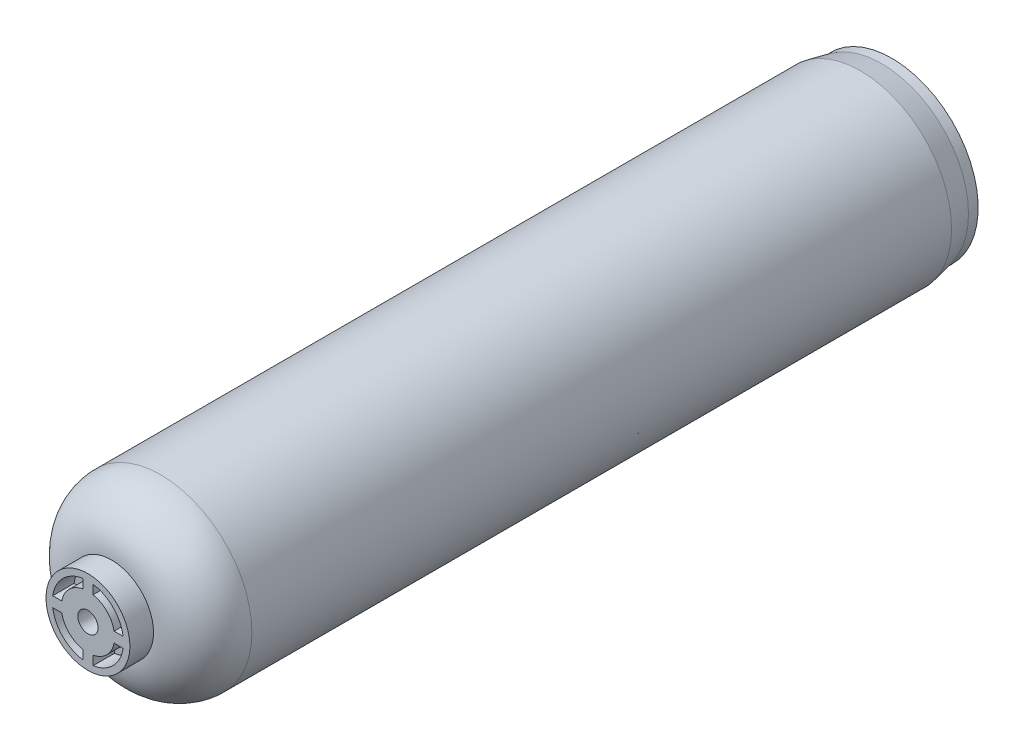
ISO-10303-21;
HEADER;
FILE_DESCRIPTION(('STEP AP214'),'2;1');
FILE_NAME('part.step','',(''),(''),'','','');
FILE_SCHEMA(('AUTOMOTIVE_DESIGN { 1 0 10303 214 1 1 1 1 }'));
ENDSEC;
DATA;
#1=APPLICATION_CONTEXT('core data for automotive mechanical design processes');
#2=APPLICATION_PROTOCOL_DEFINITION('international standard','automotive_design',2000,#1);
#3=PRODUCT_CONTEXT('',#1,'mechanical');
#4=PRODUCT('Part','Part','',(#3));
#5=PRODUCT_RELATED_PRODUCT_CATEGORY('part','',(#4));
#6=PRODUCT_DEFINITION_FORMATION('','',#4);
#7=PRODUCT_DEFINITION_CONTEXT('part definition',#1,'design');
#8=PRODUCT_DEFINITION('design','',#6,#7);
#9=PRODUCT_DEFINITION_SHAPE('','',#8);
#10=(LENGTH_UNIT() NAMED_UNIT(*) SI_UNIT(.MILLI.,.METRE.));
#11=(NAMED_UNIT(*) PLANE_ANGLE_UNIT() SI_UNIT($,.RADIAN.));
#12=(NAMED_UNIT(*) SI_UNIT($,.STERADIAN.) SOLID_ANGLE_UNIT());
#13=UNCERTAINTY_MEASURE_WITH_UNIT(LENGTH_MEASURE(1.E-05),#10,'distance_accuracy_value','');
#14=(GEOMETRIC_REPRESENTATION_CONTEXT(3) GLOBAL_UNCERTAINTY_ASSIGNED_CONTEXT((#13)) GLOBAL_UNIT_ASSIGNED_CONTEXT((#10,
#11,#12)) REPRESENTATION_CONTEXT('',''));
#15=CARTESIAN_POINT('',(0.,0.,0.));
#16=DIRECTION('',(0.,0.,1.));
#17=DIRECTION('',(1.,0.,0.));
#18=AXIS2_PLACEMENT_3D('',#15,#16,#17);
#19=CARTESIAN_POINT('',(0.,28.194,-273.742032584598));
#20=DIRECTION('',(0.,0.,-1.));
#21=DIRECTION('',(-1.,0.,0.));
#22=AXIS2_PLACEMENT_3D('',#19,#20,#21);
#23=PLANE('',#22);
#24=CARTESIAN_POINT('',(0.,0.,-273.742032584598));
#25=DIRECTION('',(0.,0.,-1.));
#26=DIRECTION('',(-1.,0.,0.));
#27=AXIS2_PLACEMENT_3D('',#24,#25,#26);
#28=CIRCLE('',#27,28.194);
#29=CARTESIAN_POINT('',(-28.194,0.,-273.742032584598));
#30=VERTEX_POINT('',#29);
#31=EDGE_CURVE('E324',#30,#30,#28,.T.);
#32=ORIENTED_EDGE('',*,*,#31,.T.);
#33=EDGE_LOOP('',(#32));
#34=FACE_BOUND('',#33,.T.);
#35=CARTESIAN_POINT('',(0.,0.,-273.742032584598));
#36=DIRECTION('',(0.,0.,-1.));
#37=DIRECTION('',(-1.,0.,0.));
#38=AXIS2_PLACEMENT_3D('',#35,#36,#37);
#39=CIRCLE('',#38,28.575);
#40=CARTESIAN_POINT('',(-28.575,0.,-273.742032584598));
#41=VERTEX_POINT('',#40);
#42=EDGE_CURVE('E321',#41,#41,#39,.F.);
#43=ORIENTED_EDGE('',*,*,#42,.T.);
#44=EDGE_LOOP('',(#43));
#45=FACE_BOUND('',#44,.T.);
#46=ADVANCED_FACE('F25',(#34,#45),#23,.F.);
#47=CARTESIAN_POINT('',(0.,0.,0.));
#48=DIRECTION('',(0.,0.,-1.));
#49=DIRECTION('',(-1.,0.,0.));
#50=AXIS2_PLACEMENT_3D('',#47,#48,#49);
#51=CYLINDRICAL_SURFACE('',#50,28.194);
#52=CARTESIAN_POINT('',(0.,0.,-279.584032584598));
#53=DIRECTION('',(0.,0.,-1.));
#54=DIRECTION('',(-1.,0.,0.));
#55=AXIS2_PLACEMENT_3D('',#52,#53,#54);
#56=CIRCLE('',#55,28.194);
#57=CARTESIAN_POINT('',(-28.194,0.,-279.584032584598));
#58=VERTEX_POINT('',#57);
#59=EDGE_CURVE('E318',#58,#58,#56,.T.);
#60=ORIENTED_EDGE('',*,*,#59,.T.);
#61=EDGE_LOOP('',(#60));
#62=FACE_BOUND('',#61,.T.);
#63=ORIENTED_EDGE('',*,*,#31,.F.);
#64=EDGE_LOOP('',(#63));
#65=FACE_BOUND('',#64,.T.);
#66=ADVANCED_FACE('F330',(#62,#65),#51,.F.);
#67=CARTESIAN_POINT('',(0.,0.,0.));
#68=DIRECTION('',(0.,0.,-1.));
#69=DIRECTION('',(-1.,0.,0.));
#70=AXIS2_PLACEMENT_3D('',#67,#68,#69);
#71=CYLINDRICAL_SURFACE('',#70,28.575);
#72=ORIENTED_EDGE('',*,*,#42,.F.);
#73=EDGE_LOOP('',(#72));
#74=FACE_BOUND('',#73,.T.);
#75=CARTESIAN_POINT('',(0.,0.,-271.329032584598));
#76=DIRECTION('',(0.,0.,-1.));
#77=DIRECTION('',(-1.,0.,0.));
#78=AXIS2_PLACEMENT_3D('',#75,#76,#77);
#79=CIRCLE('',#78,28.575);
#80=CARTESIAN_POINT('',(-28.575,0.,-271.329032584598));
#81=VERTEX_POINT('',#80);
#82=EDGE_CURVE('E315',#81,#81,#79,.F.);
#83=ORIENTED_EDGE('',*,*,#82,.T.);
#84=EDGE_LOOP('',(#83));
#85=FACE_BOUND('',#84,.T.);
#86=ADVANCED_FACE('F332',(#74,#85),#71,.F.);
#87=CARTESIAN_POINT('',(0.,28.575,-279.584032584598));
#88=DIRECTION('',(0.,0.,1.));
#89=DIRECTION('',(1.,0.,0.));
#90=AXIS2_PLACEMENT_3D('',#87,#88,#89);
#91=PLANE('',#90);
#92=ORIENTED_EDGE('',*,*,#59,.F.);
#93=EDGE_LOOP('',(#92));
#94=FACE_BOUND('',#93,.T.);
#95=CARTESIAN_POINT('',(0.,0.,-279.584032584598));
#96=DIRECTION('',(0.,0.,-1.));
#97=DIRECTION('',(-1.,0.,0.));
#98=AXIS2_PLACEMENT_3D('',#95,#96,#97);
#99=CIRCLE('',#98,28.575);
#100=CARTESIAN_POINT('',(-28.575,0.,-279.584032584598));
#101=VERTEX_POINT('',#100);
#102=EDGE_CURVE('E312',#101,#101,#99,.T.);
#103=ORIENTED_EDGE('',*,*,#102,.T.);
#104=EDGE_LOOP('',(#103));
#105=FACE_BOUND('',#104,.T.);
#106=ADVANCED_FACE('F339',(#94,#105),#91,.F.);
#107=CARTESIAN_POINT('',(0.,28.575,-271.329032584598));
#108=DIRECTION('',(0.,0.,1.));
#109=DIRECTION('',(1.,0.,0.));
#110=AXIS2_PLACEMENT_3D('',#107,#108,#109);
#111=PLANE('',#110);
#112=CARTESIAN_POINT('',(0.,0.,-271.329032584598));
#113=DIRECTION('',(0.,0.,-1.));
#114=DIRECTION('',(-1.,0.,0.));
#115=AXIS2_PLACEMENT_3D('',#112,#113,#114);
#116=CIRCLE('',#115,28.194);
#117=CARTESIAN_POINT('',(-28.194,0.,-271.329032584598));
#118=VERTEX_POINT('',#117);
#119=EDGE_CURVE('E309',#118,#118,#116,.F.);
#120=ORIENTED_EDGE('',*,*,#119,.T.);
#121=EDGE_LOOP('',(#120));
#122=FACE_BOUND('',#121,.T.);
#123=ORIENTED_EDGE('',*,*,#82,.F.);
#124=EDGE_LOOP('',(#123));
#125=FACE_BOUND('',#124,.T.);
#126=ADVANCED_FACE('F528',(#122,#125),#111,.F.);
#127=CARTESIAN_POINT('',(0.,0.,0.));
#128=DIRECTION('',(0.,0.,-1.));
#129=DIRECTION('',(-1.,0.,0.));
#130=AXIS2_PLACEMENT_3D('',#127,#128,#129);
#131=CYLINDRICAL_SURFACE('',#130,28.575);
#132=CARTESIAN_POINT('',(0.,0.,-283.648032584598));
#133=DIRECTION('',(0.,0.,-1.));
#134=DIRECTION('',(-1.,0.,0.));
#135=AXIS2_PLACEMENT_3D('',#132,#133,#134);
#136=CIRCLE('',#135,28.575);
#137=CARTESIAN_POINT('',(-28.575,0.,-283.648032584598));
#138=VERTEX_POINT('',#137);
#139=EDGE_CURVE('E247',#138,#138,#136,.T.);
#140=ORIENTED_EDGE('',*,*,#139,.T.);
#141=EDGE_LOOP('',(#140));
#142=FACE_BOUND('',#141,.T.);
#143=ORIENTED_EDGE('',*,*,#102,.F.);
#144=EDGE_LOOP('',(#143));
#145=FACE_BOUND('',#144,.T.);
#146=ADVANCED_FACE('F522',(#142,#145),#131,.F.);
#147=CARTESIAN_POINT('',(0.,0.,0.));
#148=DIRECTION('',(0.,0.,-1.));
#149=DIRECTION('',(-1.,0.,0.));
#150=AXIS2_PLACEMENT_3D('',#147,#148,#149);
#151=CYLINDRICAL_SURFACE('',#150,28.194);
#152=ORIENTED_EDGE('',*,*,#119,.F.);
#153=EDGE_LOOP('',(#152));
#154=FACE_BOUND('',#153,.T.);
#155=CARTESIAN_POINT('',(0.,0.,-25.9842));
#156=DIRECTION('',(0.,0.,1.));
#157=DIRECTION('',(1.,0.,0.));
#158=AXIS2_PLACEMENT_3D('',#155,#156,#157);
#159=CIRCLE('',#158,28.194);
#160=CARTESIAN_POINT('',(28.194,0.,-25.9842));
#161=VERTEX_POINT('',#160);
#162=EDGE_CURVE('E239',#161,#161,#159,.T.);
#163=ORIENTED_EDGE('',*,*,#162,.T.);
#164=EDGE_LOOP('',(#163));
#165=FACE_BOUND('',#164,.T.);
#166=ADVANCED_FACE('F517',(#154,#165),#151,.F.);
#167=CARTESIAN_POINT('',(0.,29.5275,-283.648032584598));
#168=DIRECTION('',(0.,0.,1.));
#169=DIRECTION('',(1.,0.,0.));
#170=AXIS2_PLACEMENT_3D('',#167,#168,#169);
#171=PLANE('',#170);
#172=ORIENTED_EDGE('',*,*,#139,.F.);
#173=EDGE_LOOP('',(#172));
#174=FACE_BOUND('',#173,.T.);
#175=CARTESIAN_POINT('',(0.,0.,-283.648032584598));
#176=DIRECTION('',(0.,0.,-1.));
#177=DIRECTION('',(-1.,0.,0.));
#178=AXIS2_PLACEMENT_3D('',#175,#176,#177);
#179=CIRCLE('',#178,29.5275);
#180=CARTESIAN_POINT('',(-29.5275,0.,-283.648032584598));
#181=VERTEX_POINT('',#180);
#182=EDGE_CURVE('E160',#181,#181,#179,.T.);
#183=ORIENTED_EDGE('',*,*,#182,.T.);
#184=EDGE_LOOP('',(#183));
#185=FACE_BOUND('',#184,.T.);
#186=ADVANCED_FACE('F231',(#174,#185),#171,.F.);
#187=CARTESIAN_POINT('',(0.,0.,-25.9842));
#188=DIRECTION('',(0.,0.,1.));
#189=DIRECTION('',(1.,0.,0.));
#190=AXIS2_PLACEMENT_3D('',#187,#188,#189);
#191=TOROIDAL_SURFACE('',#190,14.9606,13.2334);
#192=ORIENTED_EDGE('',*,*,#162,.F.);
#193=EDGE_LOOP('',(#192));
#194=FACE_BOUND('',#193,.T.);
#195=CARTESIAN_POINT('',(0.,0.,-12.7508));
#196=DIRECTION('',(0.,0.,1.));
#197=DIRECTION('',(-1.,0.,0.));
#198=AXIS2_PLACEMENT_3D('',#195,#196,#197);
#199=CIRCLE('',#198,14.9606);
#200=CARTESIAN_POINT('',(-14.9606,0.,-12.7508));
#201=VERTEX_POINT('',#200);
#202=CARTESIAN_POINT('',(14.9606,0.,-12.7508));
#203=VERTEX_POINT('',#202);
#204=EDGE_CURVE('E147',#201,#203,#199,.T.);
#205=ORIENTED_EDGE('',*,*,#204,.T.);
#206=CARTESIAN_POINT('',(0.,0.,-12.7508));
#207=DIRECTION('',(0.,0.,1.));
#208=DIRECTION('',(1.,0.,0.));
#209=AXIS2_PLACEMENT_3D('',#206,#207,#208);
#210=CIRCLE('',#209,14.9606);
#211=EDGE_CURVE('E150',#203,#201,#210,.T.);
#212=ORIENTED_EDGE('',*,*,#211,.T.);
#213=EDGE_LOOP('',(#205,#212));
#214=FACE_BOUND('',#213,.T.);
#215=ADVANCED_FACE('F152',(#194,#214),#191,.F.);
#216=CARTESIAN_POINT('',(0.,0.,0.));
#217=DIRECTION('',(0.,0.,-1.));
#218=DIRECTION('',(-1.,0.,0.));
#219=AXIS2_PLACEMENT_3D('',#216,#217,#218);
#220=CYLINDRICAL_SURFACE('',#219,29.5275);
#221=CARTESIAN_POINT('',(0.,0.,-286.823032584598));
#222=DIRECTION('',(0.,0.,1.));
#223=DIRECTION('',(1.,0.,0.));
#224=AXIS2_PLACEMENT_3D('',#221,#222,#223);
#225=CIRCLE('',#224,29.5275);
#226=CARTESIAN_POINT('',(29.5275,0.,-286.823032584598));
#227=VERTEX_POINT('',#226);
#228=EDGE_CURVE('E155',#227,#227,#225,.T.);
#229=ORIENTED_EDGE('',*,*,#228,.F.);
#230=EDGE_LOOP('',(#229));
#231=FACE_BOUND('',#230,.T.);
#232=ORIENTED_EDGE('',*,*,#182,.F.);
#233=EDGE_LOOP('',(#232));
#234=FACE_BOUND('',#233,.T.);
#235=ADVANCED_FACE('F230',(#231,#234),#220,.F.);
#236=CARTESIAN_POINT('',(0.,0.,-7.62));
#237=DIRECTION('',(0.,0.,1.));
#238=DIRECTION('',(1.,0.,0.));
#239=AXIS2_PLACEMENT_3D('',#236,#237,#238);
#240=PLANE('',#239);
#241=CARTESIAN_POINT('',(0.,0.,-7.62));
#242=DIRECTION('',(0.,0.,-1.));
#243=DIRECTION('',(-1.,0.,0.));
#244=AXIS2_PLACEMENT_3D('',#241,#242,#243);
#245=CIRCLE('',#244,9.525);
#246=CARTESIAN_POINT('',(9.34529307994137,1.8415,-7.62));
#247=VERTEX_POINT('',#246);
#248=CARTESIAN_POINT('',(1.8415,9.34529307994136,-7.62));
#249=VERTEX_POINT('',#248);
#250=EDGE_CURVE('E140',#247,#249,#245,.F.);
#251=ORIENTED_EDGE('',*,*,#250,.F.);
#252=DIRECTION('',(1.,0.,0.));
#253=VECTOR('',#252,1.);
#254=CARTESIAN_POINT('',(9.34529307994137,1.8415,-7.62));
#255=LINE('',#254,#253);
#256=CARTESIAN_POINT('',(12.5657820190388,1.8415,-7.62));
#257=VERTEX_POINT('',#256);
#258=EDGE_CURVE('E220',#247,#257,#255,.T.);
#259=ORIENTED_EDGE('',*,*,#258,.T.);
#260=CARTESIAN_POINT('',(0.,0.,-7.62));
#261=DIRECTION('',(0.,0.,-1.));
#262=DIRECTION('',(-1.,0.,0.));
#263=AXIS2_PLACEMENT_3D('',#260,#261,#262);
#264=CIRCLE('',#263,12.7);
#265=CARTESIAN_POINT('',(1.8415,12.5657820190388,-7.62));
#266=VERTEX_POINT('',#265);
#267=EDGE_CURVE('E302',#257,#266,#264,.F.);
#268=ORIENTED_EDGE('',*,*,#267,.T.);
#269=DIRECTION('',(0.,1.,0.));
#270=VECTOR('',#269,1.);
#271=CARTESIAN_POINT('',(1.8415,12.5657820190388,-7.62));
#272=LINE('',#271,#270);
#273=EDGE_CURVE('E216',#266,#249,#272,.F.);
#274=ORIENTED_EDGE('',*,*,#273,.T.);
#275=EDGE_LOOP('',(#251,#259,#268,#274));
#276=FACE_BOUND('',#275,.T.);
#277=ADVANCED_FACE('F408',(#276),#240,.T.);
#278=CARTESIAN_POINT('',(0.,0.,-7.62));
#279=DIRECTION('',(0.,0.,1.));
#280=DIRECTION('',(1.,0.,0.));
#281=AXIS2_PLACEMENT_3D('',#278,#279,#280);
#282=PLANE('',#281);
#283=CARTESIAN_POINT('',(0.,0.,-7.62));
#284=DIRECTION('',(0.,0.,-1.));
#285=DIRECTION('',(-1.,0.,0.));
#286=AXIS2_PLACEMENT_3D('',#283,#284,#285);
#287=CIRCLE('',#286,9.525);
#288=CARTESIAN_POINT('',(1.8415,-9.34529307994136,-7.62));
#289=VERTEX_POINT('',#288);
#290=CARTESIAN_POINT('',(9.34529307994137,-1.8415,-7.62));
#291=VERTEX_POINT('',#290);
#292=EDGE_CURVE('E299',#289,#291,#287,.F.);
#293=ORIENTED_EDGE('',*,*,#292,.F.);
#294=DIRECTION('',(0.,-1.,0.));
#295=VECTOR('',#294,1.);
#296=CARTESIAN_POINT('',(1.8415,-9.34529307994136,-7.62));
#297=LINE('',#296,#295);
#298=CARTESIAN_POINT('',(1.84150000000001,-12.5657820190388,-7.62));
#299=VERTEX_POINT('',#298);
#300=EDGE_CURVE('E212',#289,#299,#297,.T.);
#301=ORIENTED_EDGE('',*,*,#300,.T.);
#302=CARTESIAN_POINT('',(0.,0.,-7.62));
#303=DIRECTION('',(0.,0.,-1.));
#304=DIRECTION('',(-1.,0.,0.));
#305=AXIS2_PLACEMENT_3D('',#302,#303,#304);
#306=CIRCLE('',#305,12.7);
#307=CARTESIAN_POINT('',(12.5657820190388,-1.8415,-7.62));
#308=VERTEX_POINT('',#307);
#309=EDGE_CURVE('E297',#299,#308,#306,.F.);
#310=ORIENTED_EDGE('',*,*,#309,.T.);
#311=DIRECTION('',(1.,0.,0.));
#312=VECTOR('',#311,1.);
#313=CARTESIAN_POINT('',(9.34529307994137,-1.8415,-7.62));
#314=LINE('',#313,#312);
#315=EDGE_CURVE('E208',#308,#291,#314,.F.);
#316=ORIENTED_EDGE('',*,*,#315,.T.);
#317=EDGE_LOOP('',(#293,#301,#310,#316));
#318=FACE_BOUND('',#317,.T.);
#319=ADVANCED_FACE('F587',(#318),#282,.T.);
#320=CARTESIAN_POINT('',(0.,0.,-7.62));
#321=DIRECTION('',(0.,0.,1.));
#322=DIRECTION('',(1.,0.,0.));
#323=AXIS2_PLACEMENT_3D('',#320,#321,#322);
#324=PLANE('',#323);
#325=CARTESIAN_POINT('',(0.,0.,-7.62));
#326=DIRECTION('',(0.,0.,-1.));
#327=DIRECTION('',(-1.,0.,0.));
#328=AXIS2_PLACEMENT_3D('',#325,#326,#327);
#329=CIRCLE('',#328,12.7);
#330=CARTESIAN_POINT('',(-12.5657820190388,-1.8415,-7.62));
#331=VERTEX_POINT('',#330);
#332=CARTESIAN_POINT('',(-1.8415,-12.5657820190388,-7.62));
#333=VERTEX_POINT('',#332);
#334=EDGE_CURVE('E295',#331,#333,#329,.F.);
#335=ORIENTED_EDGE('',*,*,#334,.T.);
#336=DIRECTION('',(0.,1.,0.));
#337=VECTOR('',#336,1.);
#338=CARTESIAN_POINT('',(-1.8415,-9.34529307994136,-7.62));
#339=LINE('',#338,#337);
#340=CARTESIAN_POINT('',(-1.8415,-9.34529307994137,-7.62));
#341=VERTEX_POINT('',#340);
#342=EDGE_CURVE('E204',#333,#341,#339,.T.);
#343=ORIENTED_EDGE('',*,*,#342,.T.);
#344=CARTESIAN_POINT('',(0.,0.,-7.62));
#345=DIRECTION('',(0.,0.,-1.));
#346=DIRECTION('',(-1.,0.,0.));
#347=AXIS2_PLACEMENT_3D('',#344,#345,#346);
#348=CIRCLE('',#347,9.525);
#349=CARTESIAN_POINT('',(-9.34529307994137,-1.8415,-7.62));
#350=VERTEX_POINT('',#349);
#351=EDGE_CURVE('E206',#350,#341,#348,.F.);
#352=ORIENTED_EDGE('',*,*,#351,.F.);
#353=DIRECTION('',(1.,0.,0.));
#354=VECTOR('',#353,1.);
#355=CARTESIAN_POINT('',(-12.5657820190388,-1.8415,-7.62));
#356=LINE('',#355,#354);
#357=EDGE_CURVE('E200',#350,#331,#356,.F.);
#358=ORIENTED_EDGE('',*,*,#357,.T.);
#359=EDGE_LOOP('',(#335,#343,#352,#358));
#360=FACE_BOUND('',#359,.T.);
#361=ADVANCED_FACE('F595',(#360),#324,.T.);
#362=CARTESIAN_POINT('',(0.,0.,-7.62));
#363=DIRECTION('',(0.,0.,1.));
#364=DIRECTION('',(1.,0.,0.));
#365=AXIS2_PLACEMENT_3D('',#362,#363,#364);
#366=PLANE('',#365);
#367=CARTESIAN_POINT('',(0.,0.,-7.62));
#368=DIRECTION('',(0.,0.,-1.));
#369=DIRECTION('',(-1.,0.,0.));
#370=AXIS2_PLACEMENT_3D('',#367,#368,#369);
#371=CIRCLE('',#370,12.7);
#372=CARTESIAN_POINT('',(-1.8415,12.5657820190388,-7.62));
#373=VERTEX_POINT('',#372);
#374=CARTESIAN_POINT('',(-12.5657820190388,1.8415,-7.62));
#375=VERTEX_POINT('',#374);
#376=EDGE_CURVE('E290',#373,#375,#371,.F.);
#377=ORIENTED_EDGE('',*,*,#376,.T.);
#378=DIRECTION('',(1.,0.,0.));
#379=VECTOR('',#378,1.);
#380=CARTESIAN_POINT('',(-12.5657820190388,1.8415,-7.62));
#381=LINE('',#380,#379);
#382=CARTESIAN_POINT('',(-9.34529307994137,1.8415,-7.62));
#383=VERTEX_POINT('',#382);
#384=EDGE_CURVE('E196',#375,#383,#381,.T.);
#385=ORIENTED_EDGE('',*,*,#384,.T.);
#386=CARTESIAN_POINT('',(0.,0.,-7.62));
#387=DIRECTION('',(0.,0.,-1.));
#388=DIRECTION('',(-1.,0.,0.));
#389=AXIS2_PLACEMENT_3D('',#386,#387,#388);
#390=CIRCLE('',#389,9.525);
#391=CARTESIAN_POINT('',(-1.8415,9.34529307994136,-7.62));
#392=VERTEX_POINT('',#391);
#393=EDGE_CURVE('E198',#392,#383,#390,.F.);
#394=ORIENTED_EDGE('',*,*,#393,.F.);
#395=DIRECTION('',(0.,1.,0.));
#396=VECTOR('',#395,1.);
#397=CARTESIAN_POINT('',(-1.8415,12.5657820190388,-7.62));
#398=LINE('',#397,#396);
#399=EDGE_CURVE('E187',#392,#373,#398,.T.);
#400=ORIENTED_EDGE('',*,*,#399,.T.);
#401=EDGE_LOOP('',(#377,#385,#394,#400));
#402=FACE_BOUND('',#401,.T.);
#403=ADVANCED_FACE('F179',(#402),#366,.T.);
#404=CARTESIAN_POINT('',(0.,14.9606,-12.7508));
#405=DIRECTION('',(0.,0.,1.));
#406=DIRECTION('',(1.,0.,0.));
#407=AXIS2_PLACEMENT_3D('',#404,#405,#406);
#408=PLANE('',#407);
#409=CARTESIAN_POINT('',(0.,0.,-12.7508));
#410=DIRECTION('',(0.,0.,-1.));
#411=DIRECTION('',(-1.,0.,0.));
#412=AXIS2_PLACEMENT_3D('',#409,#410,#411);
#413=CIRCLE('',#412,3.6195);
#414=CARTESIAN_POINT('',(-3.6195,0.,-12.7508));
#415=VERTEX_POINT('',#414);
#416=EDGE_CURVE('E284',#415,#415,#413,.F.);
#417=ORIENTED_EDGE('',*,*,#416,.T.);
#418=EDGE_LOOP('',(#417));
#419=FACE_BOUND('',#418,.T.);
#420=ORIENTED_EDGE('',*,*,#204,.F.);
#421=ORIENTED_EDGE('',*,*,#211,.F.);
#422=EDGE_LOOP('',(#420,#421));
#423=FACE_BOUND('',#422,.T.);
#424=ADVANCED_FACE('F159',(#419,#423),#408,.F.);
#425=CARTESIAN_POINT('',(0.,0.,-286.813020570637));
#426=DIRECTION('',(0.,0.,1.));
#427=DIRECTION('',(1.,0.,0.));
#428=AXIS2_PLACEMENT_3D('',#425,#426,#427);
#429=CONICAL_SURFACE('',#428,30.7975,1.56291301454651);
#430=CARTESIAN_POINT('',(0.,0.,-286.813020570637));
#431=DIRECTION('',(0.,0.,-1.));
#432=DIRECTION('',(-1.,0.,0.));
#433=AXIS2_PLACEMENT_3D('',#430,#431,#432);
#434=CIRCLE('',#433,30.7975);
#435=CARTESIAN_POINT('',(-30.7975,0.,-286.813020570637));
#436=VERTEX_POINT('',#435);
#437=EDGE_CURVE('E163',#436,#436,#434,.F.);
#438=ORIENTED_EDGE('',*,*,#437,.F.);
#439=EDGE_LOOP('',(#438));
#440=FACE_BOUND('',#439,.T.);
#441=ORIENTED_EDGE('',*,*,#228,.T.);
#442=EDGE_LOOP('',(#441));
#443=FACE_BOUND('',#442,.T.);
#444=ADVANCED_FACE('F178',(#440,#443),#429,.T.);
#445=CARTESIAN_POINT('',(0.,0.,-7.62));
#446=DIRECTION('',(0.,0.,-1.));
#447=DIRECTION('',(-1.,0.,0.));
#448=AXIS2_PLACEMENT_3D('',#445,#446,#447);
#449=CYLINDRICAL_SURFACE('',#448,9.525);
#450=ORIENTED_EDGE('',*,*,#250,.T.);
#451=DIRECTION('',(0.,0.,1.));
#452=VECTOR('',#451,1.);
#453=CARTESIAN_POINT('',(1.8415,9.34529307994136,-7.62));
#454=LINE('',#453,#452);
#455=CARTESIAN_POINT('',(1.8415,9.34529307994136,0.));
#456=VERTEX_POINT('',#455);
#457=EDGE_CURVE('E218',#249,#456,#454,.T.);
#458=ORIENTED_EDGE('',*,*,#457,.T.);
#459=CARTESIAN_POINT('',(0.,0.,0.));
#460=DIRECTION('',(0.,0.,-1.));
#461=DIRECTION('',(-1.,0.,0.));
#462=AXIS2_PLACEMENT_3D('',#459,#460,#461);
#463=CIRCLE('',#462,9.525);
#464=CARTESIAN_POINT('',(9.34529307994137,1.8415,0.));
#465=VERTEX_POINT('',#464);
#466=EDGE_CURVE('E282',#456,#465,#463,.T.);
#467=ORIENTED_EDGE('',*,*,#466,.T.);
#468=DIRECTION('',(0.,0.,-1.));
#469=VECTOR('',#468,1.);
#470=CARTESIAN_POINT('',(9.34529307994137,1.8415,-7.62));
#471=LINE('',#470,#469);
#472=EDGE_CURVE('E223',#465,#247,#471,.T.);
#473=ORIENTED_EDGE('',*,*,#472,.T.);
#474=EDGE_LOOP('',(#450,#458,#467,#473));
#475=FACE_BOUND('',#474,.T.);
#476=ADVANCED_FACE('F400',(#475),#449,.T.);
#477=CARTESIAN_POINT('',(9.34529307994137,1.8415,-7.62));
#478=DIRECTION('',(0.,-1.,0.));
#479=DIRECTION('',(0.,0.,-1.));
#480=AXIS2_PLACEMENT_3D('',#477,#478,#479);
#481=PLANE('',#480);
#482=DIRECTION('',(0.,0.,-1.));
#483=VECTOR('',#482,1.);
#484=CARTESIAN_POINT('',(12.5657820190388,1.8415,-7.62));
#485=LINE('',#484,#483);
#486=CARTESIAN_POINT('',(12.5657820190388,1.8415,0.));
#487=VERTEX_POINT('',#486);
#488=EDGE_CURVE('E222',#487,#257,#485,.T.);
#489=ORIENTED_EDGE('',*,*,#488,.T.);
#490=ORIENTED_EDGE('',*,*,#258,.F.);
#491=ORIENTED_EDGE('',*,*,#472,.F.);
#492=DIRECTION('',(-1.,0.,0.));
#493=VECTOR('',#492,1.);
#494=CARTESIAN_POINT('',(0.,1.8415,0.));
#495=LINE('',#494,#493);
#496=EDGE_CURVE('E281',#465,#487,#495,.F.);
#497=ORIENTED_EDGE('',*,*,#496,.T.);
#498=EDGE_LOOP('',(#489,#490,#491,#497));
#499=FACE_BOUND('',#498,.T.);
#500=ADVANCED_FACE('F405',(#499),#481,.F.);
#501=CARTESIAN_POINT('',(0.,0.,-7.62));
#502=DIRECTION('',(0.,0.,-1.));
#503=DIRECTION('',(-1.,0.,0.));
#504=AXIS2_PLACEMENT_3D('',#501,#502,#503);
#505=CYLINDRICAL_SURFACE('',#504,12.7);
#506=DIRECTION('',(0.,0.,1.));
#507=VECTOR('',#506,1.);
#508=CARTESIAN_POINT('',(1.8415,12.5657820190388,-7.62));
#509=LINE('',#508,#507);
#510=CARTESIAN_POINT('',(1.8415,12.5657820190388,0.));
#511=VERTEX_POINT('',#510);
#512=EDGE_CURVE('E219',#511,#266,#509,.F.);
#513=ORIENTED_EDGE('',*,*,#512,.T.);
#514=ORIENTED_EDGE('',*,*,#267,.F.);
#515=ORIENTED_EDGE('',*,*,#488,.F.);
#516=CARTESIAN_POINT('',(0.,0.,0.));
#517=DIRECTION('',(0.,0.,-1.));
#518=DIRECTION('',(-1.,0.,0.));
#519=AXIS2_PLACEMENT_3D('',#516,#517,#518);
#520=CIRCLE('',#519,12.7);
#521=EDGE_CURVE('E279',#487,#511,#520,.F.);
#522=ORIENTED_EDGE('',*,*,#521,.T.);
#523=EDGE_LOOP('',(#513,#514,#515,#522));
#524=FACE_BOUND('',#523,.T.);
#525=ADVANCED_FACE('F412',(#524),#505,.F.);
#526=CARTESIAN_POINT('',(1.8415,12.5657820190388,-7.62));
#527=DIRECTION('',(-1.,0.,0.));
#528=DIRECTION('',(0.,0.,1.));
#529=AXIS2_PLACEMENT_3D('',#526,#527,#528);
#530=PLANE('',#529);
#531=ORIENTED_EDGE('',*,*,#457,.F.);
#532=ORIENTED_EDGE('',*,*,#273,.F.);
#533=ORIENTED_EDGE('',*,*,#512,.F.);
#534=DIRECTION('',(0.,1.,0.));
#535=VECTOR('',#534,1.);
#536=CARTESIAN_POINT('',(1.8415,3.6195,0.));
#537=LINE('',#536,#535);
#538=EDGE_CURVE('E278',#511,#456,#537,.F.);
#539=ORIENTED_EDGE('',*,*,#538,.T.);
#540=EDGE_LOOP('',(#531,#532,#533,#539));
#541=FACE_BOUND('',#540,.T.);
#542=ADVANCED_FACE('F416',(#541),#530,.F.);
#543=CARTESIAN_POINT('',(0.,0.,-7.62));
#544=DIRECTION('',(0.,0.,-1.));
#545=DIRECTION('',(-1.,0.,0.));
#546=AXIS2_PLACEMENT_3D('',#543,#544,#545);
#547=CYLINDRICAL_SURFACE('',#546,9.525);
#548=ORIENTED_EDGE('',*,*,#292,.T.);
#549=DIRECTION('',(0.,0.,1.));
#550=VECTOR('',#549,1.);
#551=CARTESIAN_POINT('',(9.34529307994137,-1.8415,-7.62));
#552=LINE('',#551,#550);
#553=CARTESIAN_POINT('',(9.34529307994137,-1.8415,0.));
#554=VERTEX_POINT('',#553);
#555=EDGE_CURVE('E210',#291,#554,#552,.T.);
#556=ORIENTED_EDGE('',*,*,#555,.T.);
#557=CARTESIAN_POINT('',(0.,0.,0.));
#558=DIRECTION('',(0.,0.,-1.));
#559=DIRECTION('',(-1.,0.,0.));
#560=AXIS2_PLACEMENT_3D('',#557,#558,#559);
#561=CIRCLE('',#560,9.525);
#562=CARTESIAN_POINT('',(1.8415,-9.34529307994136,0.));
#563=VERTEX_POINT('',#562);
#564=EDGE_CURVE('E276',#554,#563,#561,.T.);
#565=ORIENTED_EDGE('',*,*,#564,.T.);
#566=DIRECTION('',(0.,0.,1.));
#567=VECTOR('',#566,1.);
#568=CARTESIAN_POINT('',(1.8415,-9.34529307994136,-7.62));
#569=LINE('',#568,#567);
#570=EDGE_CURVE('E215',#563,#289,#569,.F.);
#571=ORIENTED_EDGE('',*,*,#570,.T.);
#572=EDGE_LOOP('',(#548,#556,#565,#571));
#573=FACE_BOUND('',#572,.T.);
#574=ADVANCED_FACE('F490',(#573),#547,.T.);
#575=CARTESIAN_POINT('',(1.8415,-9.34529307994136,-7.62));
#576=DIRECTION('',(-1.,0.,0.));
#577=DIRECTION('',(0.,-1.,0.));
#578=AXIS2_PLACEMENT_3D('',#575,#576,#577);
#579=PLANE('',#578);
#580=DIRECTION('',(0.,0.,-1.));
#581=VECTOR('',#580,1.);
#582=CARTESIAN_POINT('',(1.84150000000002,-12.5657820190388,-7.62));
#583=LINE('',#582,#581);
#584=CARTESIAN_POINT('',(1.84150000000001,-12.5657820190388,0.));
#585=VERTEX_POINT('',#584);
#586=EDGE_CURVE('E214',#585,#299,#583,.T.);
#587=ORIENTED_EDGE('',*,*,#586,.T.);
#588=ORIENTED_EDGE('',*,*,#300,.F.);
#589=ORIENTED_EDGE('',*,*,#570,.F.);
#590=DIRECTION('',(0.,1.,0.));
#591=VECTOR('',#590,1.);
#592=CARTESIAN_POINT('',(1.8415,3.6195,0.));
#593=LINE('',#592,#591);
#594=EDGE_CURVE('E275',#563,#585,#593,.F.);
#595=ORIENTED_EDGE('',*,*,#594,.T.);
#596=EDGE_LOOP('',(#587,#588,#589,#595));
#597=FACE_BOUND('',#596,.T.);
#598=ADVANCED_FACE('F486',(#597),#579,.F.);
#599=CARTESIAN_POINT('',(0.,0.,-7.62));
#600=DIRECTION('',(0.,0.,-1.));
#601=DIRECTION('',(-1.,0.,0.));
#602=AXIS2_PLACEMENT_3D('',#599,#600,#601);
#603=CYLINDRICAL_SURFACE('',#602,12.7);
#604=DIRECTION('',(0.,0.,1.));
#605=VECTOR('',#604,1.);
#606=CARTESIAN_POINT('',(12.5657820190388,-1.8415,-7.62));
#607=LINE('',#606,#605);
#608=CARTESIAN_POINT('',(12.5657820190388,-1.8415,0.));
#609=VERTEX_POINT('',#608);
#610=EDGE_CURVE('E211',#609,#308,#607,.F.);
#611=ORIENTED_EDGE('',*,*,#610,.T.);
#612=ORIENTED_EDGE('',*,*,#309,.F.);
#613=ORIENTED_EDGE('',*,*,#586,.F.);
#614=CARTESIAN_POINT('',(0.,0.,0.));
#615=DIRECTION('',(0.,0.,-1.));
#616=DIRECTION('',(-1.,0.,0.));
#617=AXIS2_PLACEMENT_3D('',#614,#615,#616);
#618=CIRCLE('',#617,12.7);
#619=EDGE_CURVE('E273',#585,#609,#618,.F.);
#620=ORIENTED_EDGE('',*,*,#619,.T.);
#621=EDGE_LOOP('',(#611,#612,#613,#620));
#622=FACE_BOUND('',#621,.T.);
#623=ADVANCED_FACE('F482',(#622),#603,.F.);
#624=CARTESIAN_POINT('',(9.34529307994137,-1.8415,-7.62));
#625=DIRECTION('',(0.,1.,0.));
#626=DIRECTION('',(0.,0.,1.));
#627=AXIS2_PLACEMENT_3D('',#624,#625,#626);
#628=PLANE('',#627);
#629=ORIENTED_EDGE('',*,*,#555,.F.);
#630=ORIENTED_EDGE('',*,*,#315,.F.);
#631=ORIENTED_EDGE('',*,*,#610,.F.);
#632=DIRECTION('',(-1.,0.,0.));
#633=VECTOR('',#632,1.);
#634=CARTESIAN_POINT('',(0.,-1.8415,0.));
#635=LINE('',#634,#633);
#636=EDGE_CURVE('E272',#609,#554,#635,.T.);
#637=ORIENTED_EDGE('',*,*,#636,.T.);
#638=EDGE_LOOP('',(#629,#630,#631,#637));
#639=FACE_BOUND('',#638,.T.);
#640=ADVANCED_FACE('F478',(#639),#628,.F.);
#641=CARTESIAN_POINT('',(0.,0.,-7.62));
#642=DIRECTION('',(0.,0.,-1.));
#643=DIRECTION('',(-1.,0.,0.));
#644=AXIS2_PLACEMENT_3D('',#641,#642,#643);
#645=CYLINDRICAL_SURFACE('',#644,12.7);
#646=DIRECTION('',(0.,0.,-1.));
#647=VECTOR('',#646,1.);
#648=CARTESIAN_POINT('',(-1.8415,-12.5657820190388,-7.62));
#649=LINE('',#648,#647);
#650=CARTESIAN_POINT('',(-1.84150000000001,-12.5657820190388,0.));
#651=VERTEX_POINT('',#650);
#652=EDGE_CURVE('E207',#651,#333,#649,.T.);
#653=ORIENTED_EDGE('',*,*,#652,.T.);
#654=ORIENTED_EDGE('',*,*,#334,.F.);
#655=DIRECTION('',(0.,0.,1.));
#656=VECTOR('',#655,1.);
#657=CARTESIAN_POINT('',(-12.5657820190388,-1.8415,-7.62));
#658=LINE('',#657,#656);
#659=CARTESIAN_POINT('',(-12.5657820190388,-1.8415,0.));
#660=VERTEX_POINT('',#659);
#661=EDGE_CURVE('E202',#331,#660,#658,.T.);
#662=ORIENTED_EDGE('',*,*,#661,.T.);
#663=CARTESIAN_POINT('',(0.,0.,0.));
#664=DIRECTION('',(0.,0.,-1.));
#665=DIRECTION('',(-1.,0.,0.));
#666=AXIS2_PLACEMENT_3D('',#663,#664,#665);
#667=CIRCLE('',#666,12.7);
#668=EDGE_CURVE('E270',#660,#651,#667,.F.);
#669=ORIENTED_EDGE('',*,*,#668,.T.);
#670=EDGE_LOOP('',(#653,#654,#662,#669));
#671=FACE_BOUND('',#670,.T.);
#672=ADVANCED_FACE('F474',(#671),#645,.F.);
#673=CARTESIAN_POINT('',(-1.8415,-9.34529307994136,-7.62));
#674=DIRECTION('',(1.,0.,0.));
#675=DIRECTION('',(0.,0.,-1.));
#676=AXIS2_PLACEMENT_3D('',#673,#674,#675);
#677=PLANE('',#676);
#678=DIRECTION('',(0.,0.,-1.));
#679=VECTOR('',#678,1.);
#680=CARTESIAN_POINT('',(-1.8415,-9.34529307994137,-7.62));
#681=LINE('',#680,#679);
#682=CARTESIAN_POINT('',(-1.8415,-9.34529307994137,0.));
#683=VERTEX_POINT('',#682);
#684=EDGE_CURVE('E294',#341,#683,#681,.F.);
#685=ORIENTED_EDGE('',*,*,#684,.F.);
#686=ORIENTED_EDGE('',*,*,#342,.F.);
#687=ORIENTED_EDGE('',*,*,#652,.F.);
#688=DIRECTION('',(0.,1.,0.));
#689=VECTOR('',#688,1.);
#690=CARTESIAN_POINT('',(-1.84150000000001,3.6195,0.));
#691=LINE('',#690,#689);
#692=EDGE_CURVE('E269',#651,#683,#691,.T.);
#693=ORIENTED_EDGE('',*,*,#692,.T.);
#694=EDGE_LOOP('',(#685,#686,#687,#693));
#695=FACE_BOUND('',#694,.T.);
#696=ADVANCED_FACE('F470',(#695),#677,.F.);
#697=CARTESIAN_POINT('',(0.,0.,-7.62));
#698=DIRECTION('',(0.,0.,-1.));
#699=DIRECTION('',(-1.,0.,0.));
#700=AXIS2_PLACEMENT_3D('',#697,#698,#699);
#701=CYLINDRICAL_SURFACE('',#700,9.525);
#702=ORIENTED_EDGE('',*,*,#351,.T.);
#703=ORIENTED_EDGE('',*,*,#684,.T.);
#704=CARTESIAN_POINT('',(0.,0.,0.));
#705=DIRECTION('',(0.,0.,-1.));
#706=DIRECTION('',(-1.,0.,0.));
#707=AXIS2_PLACEMENT_3D('',#704,#705,#706);
#708=CIRCLE('',#707,9.525);
#709=CARTESIAN_POINT('',(-9.34529307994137,-1.8415,0.));
#710=VERTEX_POINT('',#709);
#711=EDGE_CURVE('E267',#683,#710,#708,.T.);
#712=ORIENTED_EDGE('',*,*,#711,.T.);
#713=DIRECTION('',(0.,0.,1.));
#714=VECTOR('',#713,1.);
#715=CARTESIAN_POINT('',(-9.34529307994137,-1.8415,-7.62));
#716=LINE('',#715,#714);
#717=EDGE_CURVE('E203',#710,#350,#716,.F.);
#718=ORIENTED_EDGE('',*,*,#717,.T.);
#719=EDGE_LOOP('',(#702,#703,#712,#718));
#720=FACE_BOUND('',#719,.T.);
#721=ADVANCED_FACE('F466',(#720),#701,.T.);
#722=CARTESIAN_POINT('',(-12.5657820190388,-1.8415,-7.62));
#723=DIRECTION('',(0.,1.,0.));
#724=DIRECTION('',(0.,0.,1.));
#725=AXIS2_PLACEMENT_3D('',#722,#723,#724);
#726=PLANE('',#725);
#727=ORIENTED_EDGE('',*,*,#661,.F.);
#728=ORIENTED_EDGE('',*,*,#357,.F.);
#729=ORIENTED_EDGE('',*,*,#717,.F.);
#730=DIRECTION('',(-1.,0.,0.));
#731=VECTOR('',#730,1.);
#732=CARTESIAN_POINT('',(0.,-1.8415,0.));
#733=LINE('',#732,#731);
#734=EDGE_CURVE('E266',#710,#660,#733,.T.);
#735=ORIENTED_EDGE('',*,*,#734,.T.);
#736=EDGE_LOOP('',(#727,#728,#729,#735));
#737=FACE_BOUND('',#736,.T.);
#738=ADVANCED_FACE('F462',(#737),#726,.F.);
#739=CARTESIAN_POINT('',(0.,0.,-7.62));
#740=DIRECTION('',(0.,0.,-1.));
#741=DIRECTION('',(-1.,0.,0.));
#742=AXIS2_PLACEMENT_3D('',#739,#740,#741);
#743=CYLINDRICAL_SURFACE('',#742,12.7);
#744=DIRECTION('',(0.,0.,-1.));
#745=VECTOR('',#744,1.);
#746=CARTESIAN_POINT('',(-12.5657820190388,1.8415,-7.62));
#747=LINE('',#746,#745);
#748=CARTESIAN_POINT('',(-12.5657820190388,1.8415,0.));
#749=VERTEX_POINT('',#748);
#750=EDGE_CURVE('E199',#749,#375,#747,.T.);
#751=ORIENTED_EDGE('',*,*,#750,.T.);
#752=ORIENTED_EDGE('',*,*,#376,.F.);
#753=DIRECTION('',(0.,0.,-1.));
#754=VECTOR('',#753,1.);
#755=CARTESIAN_POINT('',(-1.8415,12.5657820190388,-7.62));
#756=LINE('',#755,#754);
#757=CARTESIAN_POINT('',(-1.8415,12.5657820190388,0.));
#758=VERTEX_POINT('',#757);
#759=EDGE_CURVE('E194',#373,#758,#756,.F.);
#760=ORIENTED_EDGE('',*,*,#759,.T.);
#761=CARTESIAN_POINT('',(0.,0.,0.));
#762=DIRECTION('',(0.,0.,-1.));
#763=DIRECTION('',(-1.,0.,0.));
#764=AXIS2_PLACEMENT_3D('',#761,#762,#763);
#765=CIRCLE('',#764,12.7);
#766=EDGE_CURVE('E264',#758,#749,#765,.F.);
#767=ORIENTED_EDGE('',*,*,#766,.T.);
#768=EDGE_LOOP('',(#751,#752,#760,#767));
#769=FACE_BOUND('',#768,.T.);
#770=ADVANCED_FACE('F458',(#769),#743,.F.);
#771=CARTESIAN_POINT('',(-12.5657820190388,1.8415,-7.62));
#772=DIRECTION('',(0.,-1.,0.));
#773=DIRECTION('',(0.,0.,-1.));
#774=AXIS2_PLACEMENT_3D('',#771,#772,#773);
#775=PLANE('',#774);
#776=DIRECTION('',(0.,0.,-1.));
#777=VECTOR('',#776,1.);
#778=CARTESIAN_POINT('',(-9.34529307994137,1.8415,-7.62));
#779=LINE('',#778,#777);
#780=CARTESIAN_POINT('',(-9.34529307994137,1.8415,0.));
#781=VERTEX_POINT('',#780);
#782=EDGE_CURVE('E289',#383,#781,#779,.F.);
#783=ORIENTED_EDGE('',*,*,#782,.F.);
#784=ORIENTED_EDGE('',*,*,#384,.F.);
#785=ORIENTED_EDGE('',*,*,#750,.F.);
#786=DIRECTION('',(-1.,0.,0.));
#787=VECTOR('',#786,1.);
#788=CARTESIAN_POINT('',(0.,1.8415,0.));
#789=LINE('',#788,#787);
#790=EDGE_CURVE('E263',#749,#781,#789,.F.);
#791=ORIENTED_EDGE('',*,*,#790,.T.);
#792=EDGE_LOOP('',(#783,#784,#785,#791));
#793=FACE_BOUND('',#792,.T.);
#794=ADVANCED_FACE('F455',(#793),#775,.F.);
#795=CARTESIAN_POINT('',(0.,0.,-7.62));
#796=DIRECTION('',(0.,0.,-1.));
#797=DIRECTION('',(-1.,0.,0.));
#798=AXIS2_PLACEMENT_3D('',#795,#796,#797);
#799=CYLINDRICAL_SURFACE('',#798,9.525);
#800=ORIENTED_EDGE('',*,*,#393,.T.);
#801=ORIENTED_EDGE('',*,*,#782,.T.);
#802=CARTESIAN_POINT('',(0.,0.,0.));
#803=DIRECTION('',(0.,0.,-1.));
#804=DIRECTION('',(-1.,0.,0.));
#805=AXIS2_PLACEMENT_3D('',#802,#803,#804);
#806=CIRCLE('',#805,9.525);
#807=CARTESIAN_POINT('',(-1.8415,9.34529307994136,0.));
#808=VERTEX_POINT('',#807);
#809=EDGE_CURVE('E45',#781,#808,#806,.T.);
#810=ORIENTED_EDGE('',*,*,#809,.T.);
#811=DIRECTION('',(0.,0.,-1.));
#812=VECTOR('',#811,1.);
#813=CARTESIAN_POINT('',(-1.8415,9.34529307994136,-7.62));
#814=LINE('',#813,#812);
#815=EDGE_CURVE('E195',#808,#392,#814,.T.);
#816=ORIENTED_EDGE('',*,*,#815,.T.);
#817=EDGE_LOOP('',(#800,#801,#810,#816));
#818=FACE_BOUND('',#817,.T.);
#819=ADVANCED_FACE('F451',(#818),#799,.T.);
#820=CARTESIAN_POINT('',(-1.8415,12.5657820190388,-7.62));
#821=DIRECTION('',(1.,0.,0.));
#822=DIRECTION('',(0.,0.,-1.));
#823=AXIS2_PLACEMENT_3D('',#820,#821,#822);
#824=PLANE('',#823);
#825=ORIENTED_EDGE('',*,*,#759,.F.);
#826=ORIENTED_EDGE('',*,*,#399,.F.);
#827=ORIENTED_EDGE('',*,*,#815,.F.);
#828=DIRECTION('',(0.,1.,0.));
#829=VECTOR('',#828,1.);
#830=CARTESIAN_POINT('',(-1.8415,3.6195,0.));
#831=LINE('',#830,#829);
#832=EDGE_CURVE('E261',#808,#758,#831,.T.);
#833=ORIENTED_EDGE('',*,*,#832,.T.);
#834=EDGE_LOOP('',(#825,#826,#827,#833));
#835=FACE_BOUND('',#834,.T.);
#836=ADVANCED_FACE('F447',(#835),#824,.F.);
#837=CARTESIAN_POINT('',(0.,0.,0.));
#838=DIRECTION('',(0.,0.,-1.));
#839=DIRECTION('',(-1.,0.,0.));
#840=AXIS2_PLACEMENT_3D('',#837,#838,#839);
#841=CYLINDRICAL_SURFACE('',#840,3.6195);
#842=ORIENTED_EDGE('',*,*,#416,.F.);
#843=EDGE_LOOP('',(#842));
#844=FACE_BOUND('',#843,.T.);
#845=CARTESIAN_POINT('',(0.,0.,0.));
#846=DIRECTION('',(0.,0.,-1.));
#847=DIRECTION('',(-1.,0.,0.));
#848=AXIS2_PLACEMENT_3D('',#845,#846,#847);
#849=CIRCLE('',#848,3.6195);
#850=CARTESIAN_POINT('',(-3.6195,0.,0.));
#851=VERTEX_POINT('',#850);
#852=EDGE_CURVE('E258',#851,#851,#849,.F.);
#853=ORIENTED_EDGE('',*,*,#852,.T.);
#854=EDGE_LOOP('',(#853));
#855=FACE_BOUND('',#854,.T.);
#856=ADVANCED_FACE('F443',(#844,#855),#841,.F.);
#857=CARTESIAN_POINT('',(0.,0.,0.));
#858=DIRECTION('',(0.,0.,-1.));
#859=DIRECTION('',(-1.,0.,0.));
#860=AXIS2_PLACEMENT_3D('',#857,#858,#859);
#861=CYLINDRICAL_SURFACE('',#860,30.7975);
#862=CARTESIAN_POINT('',(0.,0.,-283.231620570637));
#863=DIRECTION('',(0.,0.,-1.));
#864=DIRECTION('',(-1.,0.,0.));
#865=AXIS2_PLACEMENT_3D('',#862,#863,#864);
#866=CIRCLE('',#865,30.7975);
#867=CARTESIAN_POINT('',(-30.7975,0.,-283.231620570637));
#868=VERTEX_POINT('',#867);
#869=EDGE_CURVE('E255',#868,#868,#866,.T.);
#870=ORIENTED_EDGE('',*,*,#869,.T.);
#871=EDGE_LOOP('',(#870));
#872=FACE_BOUND('',#871,.T.);
#873=ORIENTED_EDGE('',*,*,#437,.T.);
#874=EDGE_LOOP('',(#873));
#875=FACE_BOUND('',#874,.T.);
#876=ADVANCED_FACE('F422',(#872,#875),#861,.T.);
#877=CARTESIAN_POINT('',(0.,3.6195,0.));
#878=DIRECTION('',(0.,0.,-1.));
#879=DIRECTION('',(-1.,0.,0.));
#880=AXIS2_PLACEMENT_3D('',#877,#878,#879);
#881=PLANE('',#880);
#882=ORIENTED_EDGE('',*,*,#852,.F.);
#883=EDGE_LOOP('',(#882));
#884=FACE_BOUND('',#883,.T.);
#885=ORIENTED_EDGE('',*,*,#809,.F.);
#886=ORIENTED_EDGE('',*,*,#790,.F.);
#887=ORIENTED_EDGE('',*,*,#766,.F.);
#888=ORIENTED_EDGE('',*,*,#832,.F.);
#889=EDGE_LOOP('',(#885,#886,#887,#888));
#890=FACE_BOUND('',#889,.T.);
#891=ORIENTED_EDGE('',*,*,#711,.F.);
#892=ORIENTED_EDGE('',*,*,#692,.F.);
#893=ORIENTED_EDGE('',*,*,#668,.F.);
#894=ORIENTED_EDGE('',*,*,#734,.F.);
#895=EDGE_LOOP('',(#891,#892,#893,#894));
#896=FACE_BOUND('',#895,.T.);
#897=ORIENTED_EDGE('',*,*,#619,.F.);
#898=ORIENTED_EDGE('',*,*,#594,.F.);
#899=ORIENTED_EDGE('',*,*,#564,.F.);
#900=ORIENTED_EDGE('',*,*,#636,.F.);
#901=EDGE_LOOP('',(#897,#898,#899,#900));
#902=FACE_BOUND('',#901,.T.);
#903=ORIENTED_EDGE('',*,*,#521,.F.);
#904=ORIENTED_EDGE('',*,*,#496,.F.);
#905=ORIENTED_EDGE('',*,*,#466,.F.);
#906=ORIENTED_EDGE('',*,*,#538,.F.);
#907=EDGE_LOOP('',(#903,#904,#905,#906));
#908=FACE_BOUND('',#907,.T.);
#909=CARTESIAN_POINT('',(0.,0.,0.));
#910=DIRECTION('',(0.,0.,-1.));
#911=DIRECTION('',(-1.,0.,0.));
#912=AXIS2_PLACEMENT_3D('',#909,#910,#911);
#913=CIRCLE('',#912,14.9606);
#914=CARTESIAN_POINT('',(-14.9606,0.,0.));
#915=VERTEX_POINT('',#914);
#916=EDGE_CURVE('E252',#915,#915,#913,.T.);
#917=ORIENTED_EDGE('',*,*,#916,.F.);
#918=EDGE_LOOP('',(#917));
#919=FACE_BOUND('',#918,.T.);
#920=ADVANCED_FACE('F418',(#884,#890,#896,#902,#908,#919),#881,.F.);
#921=CARTESIAN_POINT('',(0.,30.9245,-283.231620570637));
#922=DIRECTION('',(0.,0.,1.));
#923=DIRECTION('',(1.,0.,0.));
#924=AXIS2_PLACEMENT_3D('',#921,#922,#923);
#925=PLANE('',#924);
#926=ORIENTED_EDGE('',*,*,#869,.F.);
#927=EDGE_LOOP('',(#926));
#928=FACE_BOUND('',#927,.T.);
#929=CARTESIAN_POINT('',(0.,0.,-283.231620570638));
#930=DIRECTION('',(0.,0.,1.));
#931=DIRECTION('',(1.,0.,0.));
#932=AXIS2_PLACEMENT_3D('',#929,#930,#931);
#933=CIRCLE('',#932,30.9245);
#934=CARTESIAN_POINT('',(30.9245,0.,-283.231620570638));
#935=VERTEX_POINT('',#934);
#936=EDGE_CURVE('E248',#935,#935,#933,.T.);
#937=ORIENTED_EDGE('',*,*,#936,.F.);
#938=EDGE_LOOP('',(#937));
#939=FACE_BOUND('',#938,.T.);
#940=ADVANCED_FACE('F421',(#928,#939),#925,.F.);
#941=CARTESIAN_POINT('',(0.,0.,0.));
#942=DIRECTION('',(0.,0.,-1.));
#943=DIRECTION('',(-1.,0.,0.));
#944=AXIS2_PLACEMENT_3D('',#941,#942,#943);
#945=CYLINDRICAL_SURFACE('',#944,14.9606);
#946=ORIENTED_EDGE('',*,*,#916,.T.);
#947=EDGE_LOOP('',(#946));
#948=FACE_BOUND('',#947,.T.);
#949=CARTESIAN_POINT('',(0.,0.,-8.4328));
#950=DIRECTION('',(0.,0.,1.));
#951=DIRECTION('',(1.,0.,0.));
#952=AXIS2_PLACEMENT_3D('',#949,#950,#951);
#953=CIRCLE('',#952,14.9606);
#954=CARTESIAN_POINT('',(14.9606,0.,-8.4328));
#955=VERTEX_POINT('',#954);
#956=EDGE_CURVE('E251',#955,#955,#953,.F.);
#957=ORIENTED_EDGE('',*,*,#956,.F.);
#958=EDGE_LOOP('',(#957));
#959=FACE_BOUND('',#958,.T.);
#960=ADVANCED_FACE('F427',(#948,#959),#945,.T.);
#961=CARTESIAN_POINT('',(0.,0.,-275.611620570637));
#962=DIRECTION('',(0.,0.,1.));
#963=DIRECTION('',(1.,0.,0.));
#964=AXIS2_PLACEMENT_3D('',#961,#962,#963);
#965=CONICAL_SURFACE('',#964,32.5120000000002,0.205395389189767);
#966=CARTESIAN_POINT('',(0.,0.,-275.611620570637));
#967=DIRECTION('',(0.,0.,-1.));
#968=DIRECTION('',(-1.,0.,0.));
#969=AXIS2_PLACEMENT_3D('',#966,#967,#968);
#970=CIRCLE('',#969,32.512);
#971=CARTESIAN_POINT('',(-32.512,0.,-275.611620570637));
#972=VERTEX_POINT('',#971);
#973=EDGE_CURVE('E36',#972,#972,#970,.F.);
#974=ORIENTED_EDGE('',*,*,#973,.F.);
#975=EDGE_LOOP('',(#974));
#976=FACE_BOUND('',#975,.T.);
#977=ORIENTED_EDGE('',*,*,#936,.T.);
#978=EDGE_LOOP('',(#977));
#979=FACE_BOUND('',#978,.T.);
#980=ADVANCED_FACE('F350',(#976,#979),#965,.T.);
#981=CARTESIAN_POINT('',(14.9606,0.,-25.9842));
#982=DIRECTION('',(0.,1.,0.));
#983=DIRECTION('',(1.,0.,0.));
#984=AXIS2_PLACEMENT_3D('',#981,#982,#983);
#985=CIRCLE('',#984,17.5514);
#986=TRIMMED_CURVE('',#985,(PARAMETER_VALUE(-2.59133121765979)),
(PARAMETER_VALUE(2.59133121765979)),.T.,.PARAMETER.);
#987=CARTESIAN_POINT('',(0.,0.,-25.9842));
#988=DIRECTION('',(0.,0.,1.));
#989=AXIS1_PLACEMENT('',#987,#988);
#990=SURFACE_OF_REVOLUTION('',#986,#989);
#991=ORIENTED_EDGE('',*,*,#956,.T.);
#992=EDGE_LOOP('',(#991));
#993=FACE_BOUND('',#992,.T.);
#994=CARTESIAN_POINT('',(0.,0.,-25.9842));
#995=DIRECTION('',(0.,0.,-1.));
#996=DIRECTION('',(-1.,0.,0.));
#997=AXIS2_PLACEMENT_3D('',#994,#995,#996);
#998=CIRCLE('',#997,32.512);
#999=CARTESIAN_POINT('',(-32.512,0.,-25.9842));
#1000=VERTEX_POINT('',#999);
#1001=EDGE_CURVE('E13',#1000,#1000,#998,.T.);
#1002=ORIENTED_EDGE('',*,*,#1001,.F.);
#1003=EDGE_LOOP('',(#1002));
#1004=FACE_BOUND('',#1003,.T.);
#1005=ADVANCED_FACE('F344',(#993,#1004),#990,.F.);
#1006=CARTESIAN_POINT('',(0.,0.,0.));
#1007=DIRECTION('',(0.,0.,-1.));
#1008=DIRECTION('',(-1.,0.,0.));
#1009=AXIS2_PLACEMENT_3D('',#1006,#1007,#1008);
#1010=CYLINDRICAL_SURFACE('',#1009,32.512);
#1011=ORIENTED_EDGE('',*,*,#1001,.T.);
#1012=EDGE_LOOP('',(#1011));
#1013=FACE_BOUND('',#1012,.T.);
#1014=ORIENTED_EDGE('',*,*,#973,.T.);
#1015=EDGE_LOOP('',(#1014));
#1016=FACE_BOUND('',#1015,.T.);
#1017=ADVANCED_FACE('F342',(#1013,#1016),#1010,.T.);
#1018=CLOSED_SHELL('',(#46,#66,#86,#106,#126,#146,#166,#186,#215,#235,#277,#319,#361,#403,#424,
#444,#476,#500,#525,#542,#574,#598,#623,#640,#672,#696,#721,#738,#770,#794,#819,#836,#856,#876,
#920,#940,#960,#980,#1005,#1017));
#1019=MANIFOLD_SOLID_BREP('B1',#1018);
#1020=ADVANCED_BREP_SHAPE_REPRESENTATION('',(#18,#1019),#14);
#1021=SHAPE_DEFINITION_REPRESENTATION(#9,#1020);
ENDSEC;
END-ISO-10303-21;
